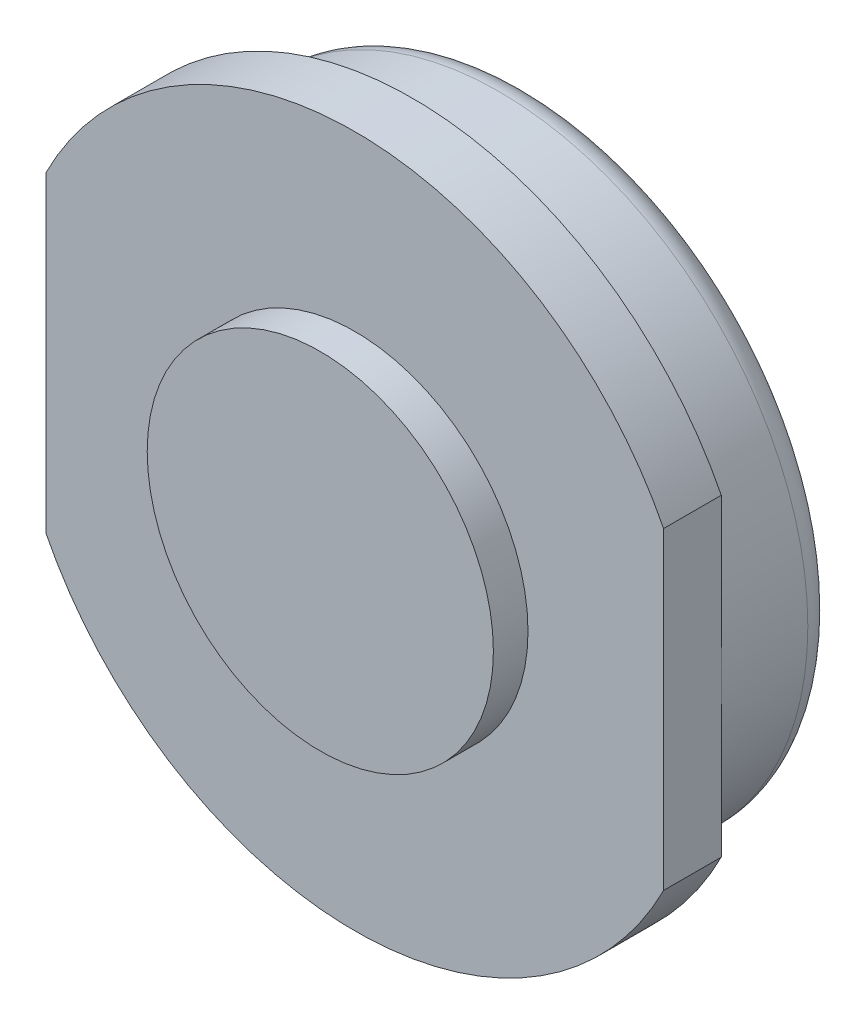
ISO-10303-21;
HEADER;
FILE_DESCRIPTION(('STEP AP214'),'2;1');
FILE_NAME('part.step','',(''),(''),'','','');
FILE_SCHEMA(('AUTOMOTIVE_DESIGN { 1 0 10303 214 1 1 1 1 }'));
ENDSEC;
DATA;
#1=APPLICATION_CONTEXT('core data for automotive mechanical design processes');
#2=APPLICATION_PROTOCOL_DEFINITION('international standard','automotive_design',2000,#1);
#3=PRODUCT_CONTEXT('',#1,'mechanical');
#4=PRODUCT('Part','Part','',(#3));
#5=PRODUCT_RELATED_PRODUCT_CATEGORY('part','',(#4));
#6=PRODUCT_DEFINITION_FORMATION('','',#4);
#7=PRODUCT_DEFINITION_CONTEXT('part definition',#1,'design');
#8=PRODUCT_DEFINITION('design','',#6,#7);
#9=PRODUCT_DEFINITION_SHAPE('','',#8);
#10=(LENGTH_UNIT() NAMED_UNIT(*) SI_UNIT(.MILLI.,.METRE.));
#11=(NAMED_UNIT(*) PLANE_ANGLE_UNIT() SI_UNIT($,.RADIAN.));
#12=(NAMED_UNIT(*) SI_UNIT($,.STERADIAN.) SOLID_ANGLE_UNIT());
#13=UNCERTAINTY_MEASURE_WITH_UNIT(LENGTH_MEASURE(1.E-05),#10,'distance_accuracy_value','');
#14=(GEOMETRIC_REPRESENTATION_CONTEXT(3) GLOBAL_UNCERTAINTY_ASSIGNED_CONTEXT((#13)) GLOBAL_UNIT_ASSIGNED_CONTEXT((#10,
#11,#12)) REPRESENTATION_CONTEXT('',''));
#15=CARTESIAN_POINT('',(0.,0.,0.));
#16=DIRECTION('',(0.,0.,1.));
#17=DIRECTION('',(1.,0.,0.));
#18=AXIS2_PLACEMENT_3D('',#15,#16,#17);
#19=CARTESIAN_POINT('',(0.,0.,3.));
#20=DIRECTION('',(0.,0.,-1.));
#21=DIRECTION('',(-1.,0.,0.));
#22=AXIS2_PLACEMENT_3D('',#19,#20,#21);
#23=CYLINDRICAL_SURFACE('',#22,6.);
#24=CARTESIAN_POINT('',(0.,0.,3.));
#25=DIRECTION('',(0.,0.,1.));
#26=DIRECTION('',(1.,0.,0.));
#27=AXIS2_PLACEMENT_3D('',#24,#25,#26);
#28=CIRCLE('',#27,6.);
#29=CARTESIAN_POINT('',(5.35,2.71615537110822,3.));
#30=VERTEX_POINT('',#29);
#31=CARTESIAN_POINT('',(-5.35,2.71615537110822,3.));
#32=VERTEX_POINT('',#31);
#33=EDGE_CURVE('E104',#30,#32,#28,.T.);
#34=ORIENTED_EDGE('',*,*,#33,.F.);
#35=DIRECTION('',(0.,0.,-1.));
#36=VECTOR('',#35,1.);
#37=CARTESIAN_POINT('',(5.35,2.71615537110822,3.));
#38=LINE('',#37,#36);
#39=CARTESIAN_POINT('',(5.35,2.71615537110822,2.));
#40=VERTEX_POINT('',#39);
#41=EDGE_CURVE('E84',#30,#40,#38,.T.);
#42=ORIENTED_EDGE('',*,*,#41,.T.);
#43=CARTESIAN_POINT('',(0.,0.,2.));
#44=DIRECTION('',(0.,0.,1.));
#45=DIRECTION('',(1.,0.,0.));
#46=AXIS2_PLACEMENT_3D('',#43,#44,#45);
#47=CIRCLE('',#46,6.);
#48=CARTESIAN_POINT('',(-5.35,2.71615537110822,2.));
#49=VERTEX_POINT('',#48);
#50=EDGE_CURVE('E58',#40,#49,#47,.T.);
#51=ORIENTED_EDGE('',*,*,#50,.T.);
#52=DIRECTION('',(0.,0.,-1.));
#53=VECTOR('',#52,1.);
#54=CARTESIAN_POINT('',(-5.35,2.71615537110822,3.));
#55=LINE('',#54,#53);
#56=EDGE_CURVE('E110',#32,#49,#55,.T.);
#57=ORIENTED_EDGE('',*,*,#56,.F.);
#58=EDGE_LOOP('',(#34,#42,#51,#57));
#59=FACE_BOUND('',#58,.T.);
#60=ADVANCED_FACE('F35',(#59),#23,.T.);
#61=CARTESIAN_POINT('',(0.,0.,2.));
#62=DIRECTION('',(0.,0.,1.));
#63=DIRECTION('',(1.,0.,0.));
#64=AXIS2_PLACEMENT_3D('',#61,#62,#63);
#65=PLANE('',#64);
#66=ORIENTED_EDGE('',*,*,#50,.F.);
#67=DIRECTION('',(0.,-1.,0.));
#68=VECTOR('',#67,1.);
#69=CARTESIAN_POINT('',(5.35,0.,2.));
#70=LINE('',#69,#68);
#71=CARTESIAN_POINT('',(5.35,0.,2.));
#72=VERTEX_POINT('',#71);
#73=EDGE_CURVE('E11',#40,#72,#70,.T.);
#74=ORIENTED_EDGE('',*,*,#73,.T.);
#75=CARTESIAN_POINT('',(0.,0.,2.));
#76=DIRECTION('',(0.,0.,1.));
#77=DIRECTION('',(1.,0.,0.));
#78=AXIS2_PLACEMENT_3D('',#75,#76,#77);
#79=CIRCLE('',#78,5.35);
#80=CARTESIAN_POINT('',(-5.35,0.,2.));
#81=VERTEX_POINT('',#80);
#82=EDGE_CURVE('E103',#72,#81,#79,.T.);
#83=ORIENTED_EDGE('',*,*,#82,.T.);
#84=DIRECTION('',(0.,-1.,0.));
#85=VECTOR('',#84,1.);
#86=CARTESIAN_POINT('',(-5.35,2.71615537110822,2.));
#87=LINE('',#86,#85);
#88=EDGE_CURVE('E131',#49,#81,#87,.T.);
#89=ORIENTED_EDGE('',*,*,#88,.F.);
#90=EDGE_LOOP('',(#66,#74,#83,#89));
#91=FACE_BOUND('',#90,.T.);
#92=ADVANCED_FACE('F130',(#91),#65,.F.);
#93=CARTESIAN_POINT('',(0.,0.,2.));
#94=DIRECTION('',(0.,0.,-1.));
#95=DIRECTION('',(-1.,0.,0.));
#96=AXIS2_PLACEMENT_3D('',#93,#94,#95);
#97=CYLINDRICAL_SURFACE('',#96,5.35);
#98=CARTESIAN_POINT('',(0.,0.,0.5));
#99=DIRECTION('',(0.,0.,1.));
#100=DIRECTION('',(1.,0.,0.));
#101=AXIS2_PLACEMENT_3D('',#98,#99,#100);
#102=CIRCLE('',#101,5.35);
#103=CARTESIAN_POINT('',(5.35,0.,0.5));
#104=VERTEX_POINT('',#103);
#105=EDGE_CURVE('E114',#104,#104,#102,.T.);
#106=ORIENTED_EDGE('',*,*,#105,.T.);
#107=EDGE_LOOP('',(#106));
#108=FACE_BOUND('',#107,.T.);
#109=EDGE_CURVE('E106',#81,#72,#79,.T.);
#110=ORIENTED_EDGE('',*,*,#109,.F.);
#111=ORIENTED_EDGE('',*,*,#82,.F.);
#112=EDGE_LOOP('',(#110,#111));
#113=FACE_BOUND('',#112,.T.);
#114=ADVANCED_FACE('F127',(#108,#113),#97,.T.);
#115=CARTESIAN_POINT('',(0.,0.,0.));
#116=DIRECTION('',(0.,0.,1.));
#117=DIRECTION('',(1.,0.,0.));
#118=AXIS2_PLACEMENT_3D('',#115,#116,#117);
#119=PLANE('',#118);
#120=CARTESIAN_POINT('',(0.,0.,0.));
#121=DIRECTION('',(0.,0.,1.));
#122=DIRECTION('',(1.,0.,0.));
#123=AXIS2_PLACEMENT_3D('',#120,#121,#122);
#124=CIRCLE('',#123,4.85);
#125=CARTESIAN_POINT('',(4.85,0.,0.));
#126=VERTEX_POINT('',#125);
#127=EDGE_CURVE('E117',#126,#126,#124,.F.);
#128=ORIENTED_EDGE('',*,*,#127,.T.);
#129=EDGE_LOOP('',(#128));
#130=FACE_BOUND('',#129,.T.);
#131=ADVANCED_FACE('F151',(#130),#119,.F.);
#132=CARTESIAN_POINT('',(0.,0.,0.5));
#133=DIRECTION('',(0.,0.,1.));
#134=DIRECTION('',(1.,0.,0.));
#135=AXIS2_PLACEMENT_3D('',#132,#133,#134);
#136=TOROIDAL_SURFACE('',#135,4.85,0.5);
#137=ORIENTED_EDGE('',*,*,#127,.F.);
#138=EDGE_LOOP('',(#137));
#139=FACE_BOUND('',#138,.T.);
#140=ORIENTED_EDGE('',*,*,#105,.F.);
#141=EDGE_LOOP('',(#140));
#142=FACE_BOUND('',#141,.T.);
#143=ADVANCED_FACE('F37',(#139,#142),#136,.T.);
#144=CARTESIAN_POINT('',(-5.35,-2.71615537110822,2.));
#145=VERTEX_POINT('',#144);
#146=CARTESIAN_POINT('',(5.35,-2.71615537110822,2.));
#147=VERTEX_POINT('',#146);
#148=EDGE_CURVE('E97',#145,#147,#47,.T.);
#149=ORIENTED_EDGE('',*,*,#148,.T.);
#150=DIRECTION('',(0.,0.,-1.));
#151=VECTOR('',#150,1.);
#152=CARTESIAN_POINT('',(5.35,-2.71615537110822,3.));
#153=LINE('',#152,#151);
#154=CARTESIAN_POINT('',(5.35,-2.71615537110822,3.));
#155=VERTEX_POINT('',#154);
#156=EDGE_CURVE('E50',#155,#147,#153,.T.);
#157=ORIENTED_EDGE('',*,*,#156,.F.);
#158=CARTESIAN_POINT('',(-5.35,-2.71615537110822,3.));
#159=VERTEX_POINT('',#158);
#160=EDGE_CURVE('E95',#159,#155,#28,.T.);
#161=ORIENTED_EDGE('',*,*,#160,.F.);
#162=DIRECTION('',(0.,0.,-1.));
#163=VECTOR('',#162,1.);
#164=CARTESIAN_POINT('',(-5.35,-2.71615537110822,3.));
#165=LINE('',#164,#163);
#166=EDGE_CURVE('E136',#159,#145,#165,.T.);
#167=ORIENTED_EDGE('',*,*,#166,.T.);
#168=EDGE_LOOP('',(#149,#157,#161,#167));
#169=FACE_BOUND('',#168,.T.);
#170=ADVANCED_FACE('F93',(#169),#23,.T.);
#171=CARTESIAN_POINT('',(0.,0.,3.));
#172=DIRECTION('',(0.,0.,1.));
#173=DIRECTION('',(1.,0.,0.));
#174=AXIS2_PLACEMENT_3D('',#171,#172,#173);
#175=PLANE('',#174);
#176=CARTESIAN_POINT('',(0.,0.,3.));
#177=DIRECTION('',(0.,0.,1.));
#178=DIRECTION('',(1.,0.,0.));
#179=AXIS2_PLACEMENT_3D('',#176,#177,#178);
#180=CIRCLE('',#179,3.);
#181=CARTESIAN_POINT('',(3.,0.,3.));
#182=VERTEX_POINT('',#181);
#183=EDGE_CURVE('E242',#182,#182,#180,.T.);
#184=ORIENTED_EDGE('',*,*,#183,.F.);
#185=EDGE_LOOP('',(#184));
#186=FACE_BOUND('',#185,.T.);
#187=DIRECTION('',(0.,1.,0.));
#188=VECTOR('',#187,1.);
#189=CARTESIAN_POINT('',(5.35,2.71615537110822,3.));
#190=LINE('',#189,#188);
#191=EDGE_CURVE('E82',#155,#30,#190,.T.);
#192=ORIENTED_EDGE('',*,*,#191,.T.);
#193=ORIENTED_EDGE('',*,*,#33,.T.);
#194=DIRECTION('',(0.,-1.,0.));
#195=VECTOR('',#194,1.);
#196=CARTESIAN_POINT('',(-5.35,2.71615537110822,3.));
#197=LINE('',#196,#195);
#198=EDGE_CURVE('E102',#32,#159,#197,.T.);
#199=ORIENTED_EDGE('',*,*,#198,.T.);
#200=ORIENTED_EDGE('',*,*,#160,.T.);
#201=EDGE_LOOP('',(#192,#193,#199,#200));
#202=FACE_BOUND('',#201,.T.);
#203=ADVANCED_FACE('F100',(#186,#202),#175,.T.);
#204=ORIENTED_EDGE('',*,*,#109,.T.);
#205=DIRECTION('',(0.,1.,0.));
#206=VECTOR('',#205,1.);
#207=CARTESIAN_POINT('',(5.35,2.71615537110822,2.));
#208=LINE('',#207,#206);
#209=EDGE_CURVE('E88',#147,#72,#208,.T.);
#210=ORIENTED_EDGE('',*,*,#209,.F.);
#211=ORIENTED_EDGE('',*,*,#148,.F.);
#212=DIRECTION('',(0.,1.,0.));
#213=VECTOR('',#212,1.);
#214=CARTESIAN_POINT('',(-5.35,0.,2.));
#215=LINE('',#214,#213);
#216=EDGE_CURVE('E43',#145,#81,#215,.T.);
#217=ORIENTED_EDGE('',*,*,#216,.T.);
#218=EDGE_LOOP('',(#204,#210,#211,#217));
#219=FACE_BOUND('',#218,.T.);
#220=ADVANCED_FACE('F122',(#219),#65,.F.);
#221=CARTESIAN_POINT('',(-5.35,2.71615537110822,3.));
#222=DIRECTION('',(1.,0.,0.));
#223=DIRECTION('',(0.,0.,-1.));
#224=AXIS2_PLACEMENT_3D('',#221,#222,#223);
#225=PLANE('',#224);
#226=ORIENTED_EDGE('',*,*,#88,.T.);
#227=ORIENTED_EDGE('',*,*,#216,.F.);
#228=ORIENTED_EDGE('',*,*,#166,.F.);
#229=ORIENTED_EDGE('',*,*,#198,.F.);
#230=ORIENTED_EDGE('',*,*,#56,.T.);
#231=EDGE_LOOP('',(#226,#227,#228,#229,#230));
#232=FACE_BOUND('',#231,.T.);
#233=ADVANCED_FACE('F132',(#232),#225,.F.);
#234=CARTESIAN_POINT('',(5.35,2.71615537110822,3.));
#235=DIRECTION('',(-1.,0.,0.));
#236=DIRECTION('',(0.,0.,1.));
#237=AXIS2_PLACEMENT_3D('',#234,#235,#236);
#238=PLANE('',#237);
#239=ORIENTED_EDGE('',*,*,#209,.T.);
#240=ORIENTED_EDGE('',*,*,#73,.F.);
#241=ORIENTED_EDGE('',*,*,#41,.F.);
#242=ORIENTED_EDGE('',*,*,#191,.F.);
#243=ORIENTED_EDGE('',*,*,#156,.T.);
#244=EDGE_LOOP('',(#239,#240,#241,#242,#243));
#245=FACE_BOUND('',#244,.T.);
#246=ADVANCED_FACE('F83',(#245),#238,.F.);
#247=CARTESIAN_POINT('',(0.,0.,3.6));
#248=DIRECTION('',(0.,0.,-1.));
#249=DIRECTION('',(-1.,0.,0.));
#250=AXIS2_PLACEMENT_3D('',#247,#248,#249);
#251=CYLINDRICAL_SURFACE('',#250,3.);
#252=CARTESIAN_POINT('',(0.,0.,3.6));
#253=DIRECTION('',(0.,0.,1.));
#254=DIRECTION('',(1.,0.,0.));
#255=AXIS2_PLACEMENT_3D('',#252,#253,#254);
#256=CIRCLE('',#255,3.);
#257=CARTESIAN_POINT('',(3.,0.,3.6));
#258=VERTEX_POINT('',#257);
#259=EDGE_CURVE('E241',#258,#258,#256,.T.);
#260=ORIENTED_EDGE('',*,*,#259,.F.);
#261=EDGE_LOOP('',(#260));
#262=FACE_BOUND('',#261,.T.);
#263=ORIENTED_EDGE('',*,*,#183,.T.);
#264=EDGE_LOOP('',(#263));
#265=FACE_BOUND('',#264,.T.);
#266=ADVANCED_FACE('F209',(#262,#265),#251,.T.);
#267=CARTESIAN_POINT('',(0.,0.,3.6));
#268=DIRECTION('',(0.,0.,1.));
#269=DIRECTION('',(1.,0.,0.));
#270=AXIS2_PLACEMENT_3D('',#267,#268,#269);
#271=PLANE('',#270);
#272=ORIENTED_EDGE('',*,*,#259,.T.);
#273=EDGE_LOOP('',(#272));
#274=FACE_BOUND('',#273,.T.);
#275=ADVANCED_FACE('F214',(#274),#271,.T.);
#276=CLOSED_SHELL('',(#60,#92,#114,#131,#143,#170,#203,#220,#233,#246,#266,#275));
#277=MANIFOLD_SOLID_BREP('B2',#276);
#278=ADVANCED_BREP_SHAPE_REPRESENTATION('',(#18,#277),#14);
#279=SHAPE_DEFINITION_REPRESENTATION(#9,#278);
ENDSEC;
END-ISO-10303-21;
